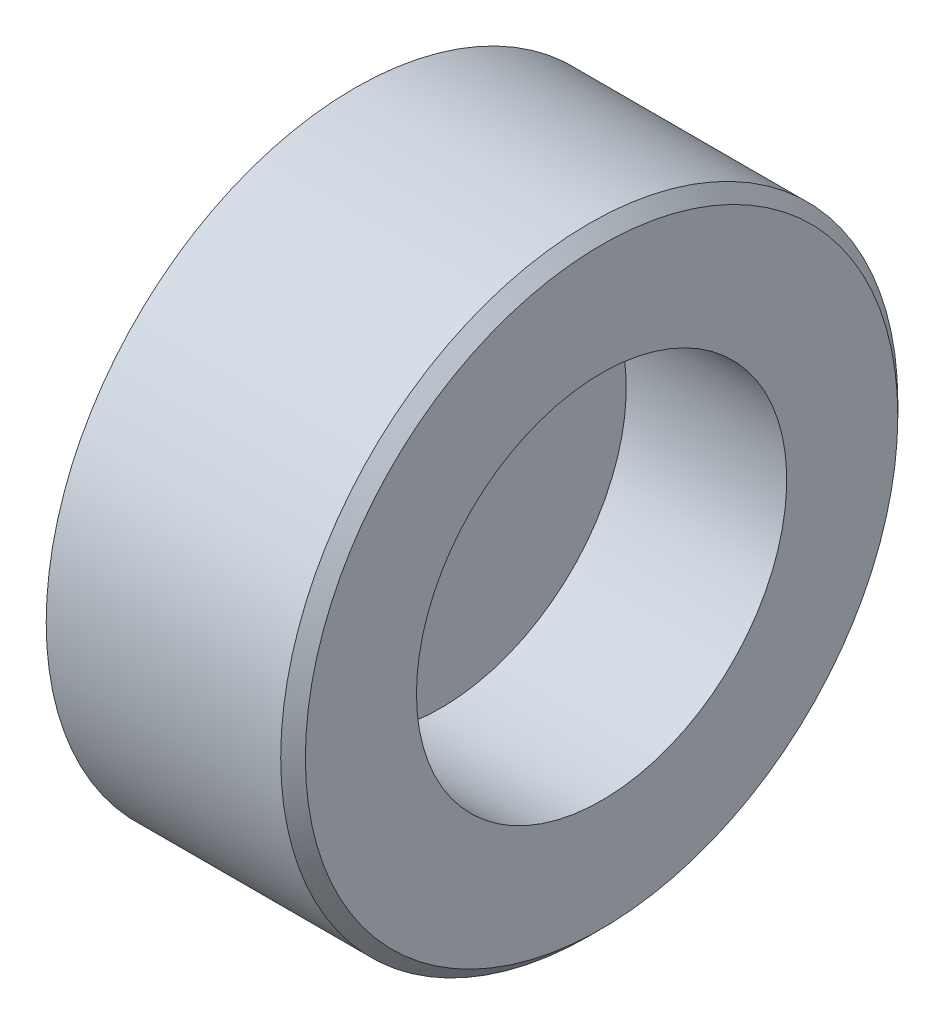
from build123d import *

# Parameters (mm, degrees)
F_0_15_0_15_DURCHMESSER_BOHRUNG1_D = 0.13125
FASE1_SIZE                         = 0.05
FASE2_SIZE                         = 0.1


with BuildPart() as part:
    # Skizze1 → Rotation1 (revolve)
    with BuildSketch(Plane.XY, mode=Mode.PRIVATE) as rotation1_sk:
        Polygon((0, 0), (0, 2.5), (2, 2.5), (2, 1.5), (0.7, 1.5), (0.7, 0), align=None)
    revolve(rotation1_sk.sketch.rotate(Axis((0, 0, 0), (1, 0, 0)), 90), axis=Axis((0, 0, 0), (1, 0, 0)))

    # 0.15 _0.15_ Durchmesser Bohrung1 (through all)
    with Locations(Plane.ZY):
        with Locations((0, -0.14), (0, 0.14)):
            Hole(F_0_15_0_15_DURCHMESSER_BOHRUNG1_D / 2)

    # Fase1
    fase1_edges = [part.edges().sort_by_distance(p)[0] for p in [
        (0.7, 0.14, 0.065625),
        (0.7, -0.14, 0.065625),
    ]]
    chamfer(fase1_edges, length=FASE1_SIZE)

    # Fase2
    fase2_edges = [part.edges().sort_by_distance(p)[0] for p in [
        (2, 0, -2.5),
    ]]
    chamfer(fase2_edges, length=FASE2_SIZE)


solid = part.part
